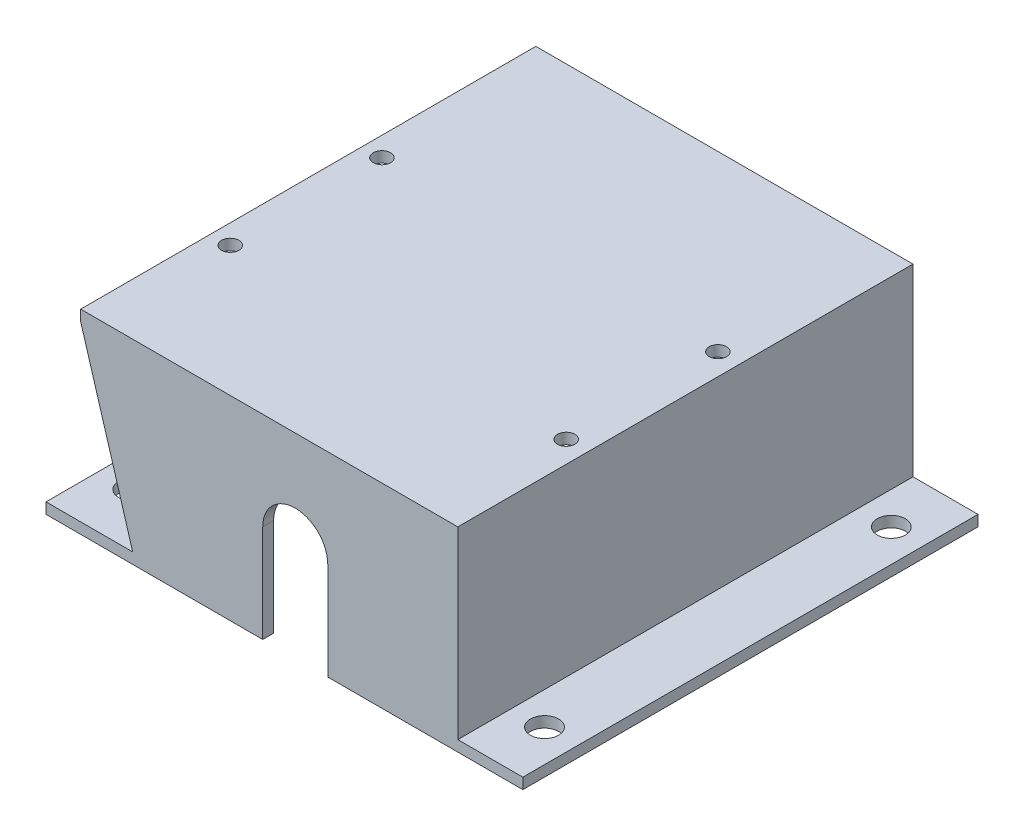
ISO-10303-21;
HEADER;
FILE_DESCRIPTION(('STEP AP214'),'2;1');
FILE_NAME('part.step','',(''),(''),'','','');
FILE_SCHEMA(('AUTOMOTIVE_DESIGN { 1 0 10303 214 1 1 1 1 }'));
ENDSEC;
DATA;
#1=APPLICATION_CONTEXT('core data for automotive mechanical design processes');
#2=APPLICATION_PROTOCOL_DEFINITION('international standard','automotive_design',2000,#1);
#3=PRODUCT_CONTEXT('',#1,'mechanical');
#4=PRODUCT('Part','Part','',(#3));
#5=PRODUCT_RELATED_PRODUCT_CATEGORY('part','',(#4));
#6=PRODUCT_DEFINITION_FORMATION('','',#4);
#7=PRODUCT_DEFINITION_CONTEXT('part definition',#1,'design');
#8=PRODUCT_DEFINITION('design','',#6,#7);
#9=PRODUCT_DEFINITION_SHAPE('','',#8);
#10=(LENGTH_UNIT() NAMED_UNIT(*) SI_UNIT(.MILLI.,.METRE.));
#11=(NAMED_UNIT(*) PLANE_ANGLE_UNIT() SI_UNIT($,.RADIAN.));
#12=(NAMED_UNIT(*) SI_UNIT($,.STERADIAN.) SOLID_ANGLE_UNIT());
#13=UNCERTAINTY_MEASURE_WITH_UNIT(LENGTH_MEASURE(1.E-05),#10,'distance_accuracy_value','');
#14=(GEOMETRIC_REPRESENTATION_CONTEXT(3) GLOBAL_UNCERTAINTY_ASSIGNED_CONTEXT((#13)) GLOBAL_UNIT_ASSIGNED_CONTEXT((#10,
#11,#12)) REPRESENTATION_CONTEXT('',''));
#15=CARTESIAN_POINT('',(0.,0.,0.));
#16=DIRECTION('',(0.,0.,1.));
#17=DIRECTION('',(1.,0.,0.));
#18=AXIS2_PLACEMENT_3D('',#15,#16,#17);
#19=CARTESIAN_POINT('',(45.,80.,210.));
#20=DIRECTION('',(-1.,0.,0.));
#21=DIRECTION('',(0.,0.,1.));
#22=AXIS2_PLACEMENT_3D('',#19,#20,#21);
#23=PLANE('',#22);
#24=DIRECTION('',(0.,-1.,0.));
#25=VECTOR('',#24,1.);
#26=CARTESIAN_POINT('',(45.,80.,5.));
#27=LINE('',#26,#25);
#28=CARTESIAN_POINT('',(45.,80.,5.));
#29=VERTEX_POINT('',#28);
#30=CARTESIAN_POINT('',(45.,-5.00000000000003,5.));
#31=VERTEX_POINT('',#30);
#32=EDGE_CURVE('E49',#29,#31,#27,.T.);
#33=ORIENTED_EDGE('',*,*,#32,.F.);
#34=DIRECTION('',(0.,0.,-1.));
#35=VECTOR('',#34,1.);
#36=CARTESIAN_POINT('',(45.,80.,210.));
#37=LINE('',#36,#35);
#38=CARTESIAN_POINT('',(45.,80.,205.));
#39=VERTEX_POINT('',#38);
#40=EDGE_CURVE('E314',#39,#29,#37,.T.);
#41=ORIENTED_EDGE('',*,*,#40,.F.);
#42=DIRECTION('',(0.,-1.,0.));
#43=VECTOR('',#42,1.);
#44=CARTESIAN_POINT('',(45.,80.,205.));
#45=LINE('',#44,#43);
#46=CARTESIAN_POINT('',(45.,-5.00000000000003,205.));
#47=VERTEX_POINT('',#46);
#48=EDGE_CURVE('E243',#39,#47,#45,.T.);
#49=ORIENTED_EDGE('',*,*,#48,.T.);
#50=DIRECTION('',(0.,0.,-1.));
#51=VECTOR('',#50,1.);
#52=CARTESIAN_POINT('',(45.,-5.00000000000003,210.));
#53=LINE('',#52,#51);
#54=EDGE_CURVE('E33',#47,#31,#53,.T.);
#55=ORIENTED_EDGE('',*,*,#54,.T.);
#56=EDGE_LOOP('',(#33,#41,#49,#55));
#57=FACE_BOUND('',#56,.T.);
#58=ADVANCED_FACE('F24',(#57),#23,.F.);
#59=CARTESIAN_POINT('',(45.,80.,210.));
#60=DIRECTION('',(0.,1.,0.));
#61=DIRECTION('',(0.,0.,1.));
#62=AXIS2_PLACEMENT_3D('',#59,#60,#61);
#63=PLANE('',#62);
#64=CARTESIAN_POINT('',(180.,80.,80.));
#65=DIRECTION('',(0.,1.,0.));
#66=DIRECTION('',(0.,0.,1.));
#67=AXIS2_PLACEMENT_3D('',#64,#65,#66);
#68=CIRCLE('',#67,3.99999999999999);
#69=CARTESIAN_POINT('',(180.,80.,84.));
#70=VERTEX_POINT('',#69);
#71=EDGE_CURVE('E665',#70,#70,#68,.T.);
#72=ORIENTED_EDGE('',*,*,#71,.T.);
#73=EDGE_LOOP('',(#72));
#74=FACE_BOUND('',#73,.T.);
#75=CARTESIAN_POINT('',(180.,80.,150.));
#76=DIRECTION('',(0.,1.,0.));
#77=DIRECTION('',(0.,0.,1.));
#78=AXIS2_PLACEMENT_3D('',#75,#76,#77);
#79=CIRCLE('',#78,4.);
#80=CARTESIAN_POINT('',(180.,80.,154.));
#81=VERTEX_POINT('',#80);
#82=EDGE_CURVE('E669',#81,#81,#79,.T.);
#83=ORIENTED_EDGE('',*,*,#82,.T.);
#84=EDGE_LOOP('',(#83));
#85=FACE_BOUND('',#84,.T.);
#86=DIRECTION('',(1.,0.,0.));
#87=VECTOR('',#86,1.);
#88=CARTESIAN_POINT('',(185.,80.,5.));
#89=LINE('',#88,#87);
#90=CARTESIAN_POINT('',(185.,80.,5.));
#91=VERTEX_POINT('',#90);
#92=EDGE_CURVE('E203',#29,#91,#89,.T.);
#93=ORIENTED_EDGE('',*,*,#92,.T.);
#94=DIRECTION('',(0.,0.,-1.));
#95=VECTOR('',#94,1.);
#96=CARTESIAN_POINT('',(185.,80.,210.));
#97=LINE('',#96,#95);
#98=CARTESIAN_POINT('',(185.,80.,205.));
#99=VERTEX_POINT('',#98);
#100=EDGE_CURVE('E311',#99,#91,#97,.T.);
#101=ORIENTED_EDGE('',*,*,#100,.F.);
#102=DIRECTION('',(-1.,0.,0.));
#103=VECTOR('',#102,1.);
#104=CARTESIAN_POINT('',(185.,80.,205.));
#105=LINE('',#104,#103);
#106=EDGE_CURVE('E227',#99,#39,#105,.T.);
#107=ORIENTED_EDGE('',*,*,#106,.T.);
#108=ORIENTED_EDGE('',*,*,#40,.T.);
#109=EDGE_LOOP('',(#93,#101,#107,#108));
#110=FACE_BOUND('',#109,.T.);
#111=ADVANCED_FACE('F394',(#74,#85,#110),#63,.F.);
#112=CARTESIAN_POINT('',(185.,80.,210.));
#113=DIRECTION('',(1.,0.,0.));
#114=DIRECTION('',(0.,1.,0.));
#115=AXIS2_PLACEMENT_3D('',#112,#113,#114);
#116=PLANE('',#115);
#117=DIRECTION('',(0.,-1.,0.));
#118=VECTOR('',#117,1.);
#119=CARTESIAN_POINT('',(185.,-5.,5.));
#120=LINE('',#119,#118);
#121=CARTESIAN_POINT('',(185.,-5.,5.));
#122=VERTEX_POINT('',#121);
#123=EDGE_CURVE('E206',#91,#122,#120,.T.);
#124=ORIENTED_EDGE('',*,*,#123,.T.);
#125=DIRECTION('',(0.,0.,-1.));
#126=VECTOR('',#125,1.);
#127=CARTESIAN_POINT('',(185.,-5.,210.));
#128=LINE('',#127,#126);
#129=CARTESIAN_POINT('',(185.,-5.,205.));
#130=VERTEX_POINT('',#129);
#131=EDGE_CURVE('E308',#130,#122,#128,.T.);
#132=ORIENTED_EDGE('',*,*,#131,.F.);
#133=DIRECTION('',(0.,1.,0.));
#134=VECTOR('',#133,1.);
#135=CARTESIAN_POINT('',(185.,-5.,205.));
#136=LINE('',#135,#134);
#137=EDGE_CURVE('E237',#130,#99,#136,.T.);
#138=ORIENTED_EDGE('',*,*,#137,.T.);
#139=ORIENTED_EDGE('',*,*,#100,.T.);
#140=EDGE_LOOP('',(#124,#132,#138,#139));
#141=FACE_BOUND('',#140,.T.);
#142=ADVANCED_FACE('F395',(#141),#116,.F.);
#143=CARTESIAN_POINT('',(40.,80.,210.));
#144=DIRECTION('',(0.,1.,0.));
#145=DIRECTION('',(0.,0.,1.));
#146=AXIS2_PLACEMENT_3D('',#143,#144,#145);
#147=PLANE('',#146);
#148=CARTESIAN_POINT('',(25.,80.,150.));
#149=DIRECTION('',(0.,1.,0.));
#150=DIRECTION('',(0.,0.,1.));
#151=AXIS2_PLACEMENT_3D('',#148,#149,#150);
#152=CIRCLE('',#151,3.99999999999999);
#153=CARTESIAN_POINT('',(25.,80.,154.));
#154=VERTEX_POINT('',#153);
#155=EDGE_CURVE('E331',#154,#154,#152,.T.);
#156=ORIENTED_EDGE('',*,*,#155,.T.);
#157=EDGE_LOOP('',(#156));
#158=FACE_BOUND('',#157,.T.);
#159=CARTESIAN_POINT('',(25.0000000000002,80.,80.));
#160=DIRECTION('',(0.,1.,0.));
#161=DIRECTION('',(0.,0.,1.));
#162=AXIS2_PLACEMENT_3D('',#159,#160,#161);
#163=CIRCLE('',#162,3.99999999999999);
#164=CARTESIAN_POINT('',(25.0000000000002,80.,84.));
#165=VERTEX_POINT('',#164);
#166=EDGE_CURVE('E318',#165,#165,#163,.T.);
#167=ORIENTED_EDGE('',*,*,#166,.T.);
#168=EDGE_LOOP('',(#167));
#169=FACE_BOUND('',#168,.T.);
#170=CARTESIAN_POINT('',(16.,80.,5.));
#171=VERTEX_POINT('',#170);
#172=CARTESIAN_POINT('',(40.,80.,5.));
#173=VERTEX_POINT('',#172);
#174=EDGE_CURVE('E204',#171,#173,#89,.T.);
#175=ORIENTED_EDGE('',*,*,#174,.T.);
#176=DIRECTION('',(0.,0.,-1.));
#177=VECTOR('',#176,1.);
#178=CARTESIAN_POINT('',(40.,80.,210.));
#179=LINE('',#178,#177);
#180=CARTESIAN_POINT('',(40.,80.,205.));
#181=VERTEX_POINT('',#180);
#182=EDGE_CURVE('E287',#181,#173,#179,.T.);
#183=ORIENTED_EDGE('',*,*,#182,.F.);
#184=CARTESIAN_POINT('',(16.,80.,205.));
#185=VERTEX_POINT('',#184);
#186=EDGE_CURVE('E226',#181,#185,#105,.T.);
#187=ORIENTED_EDGE('',*,*,#186,.T.);
#188=DIRECTION('',(0.,0.,-1.));
#189=VECTOR('',#188,1.);
#190=CARTESIAN_POINT('',(16.,80.,210.));
#191=LINE('',#190,#189);
#192=EDGE_CURVE('E290',#185,#171,#191,.T.);
#193=ORIENTED_EDGE('',*,*,#192,.T.);
#194=EDGE_LOOP('',(#175,#183,#187,#193));
#195=FACE_BOUND('',#194,.T.);
#196=ADVANCED_FACE('F397',(#158,#169,#195),#147,.F.);
#197=CARTESIAN_POINT('',(40.,0.,210.));
#198=DIRECTION('',(1.,0.,0.));
#199=DIRECTION('',(0.,0.,-1.));
#200=AXIS2_PLACEMENT_3D('',#197,#198,#199);
#201=PLANE('',#200);
#202=DIRECTION('',(0.,1.,0.));
#203=VECTOR('',#202,1.);
#204=CARTESIAN_POINT('',(40.,0.,5.));
#205=LINE('',#204,#203);
#206=CARTESIAN_POINT('',(40.,0.,5.));
#207=VERTEX_POINT('',#206);
#208=EDGE_CURVE('E218',#207,#173,#205,.T.);
#209=ORIENTED_EDGE('',*,*,#208,.F.);
#210=DIRECTION('',(0.,0.,-1.));
#211=VECTOR('',#210,1.);
#212=CARTESIAN_POINT('',(40.,0.,210.));
#213=LINE('',#212,#211);
#214=CARTESIAN_POINT('',(40.,0.,205.));
#215=VERTEX_POINT('',#214);
#216=EDGE_CURVE('E283',#215,#207,#213,.T.);
#217=ORIENTED_EDGE('',*,*,#216,.F.);
#218=DIRECTION('',(0.,1.,0.));
#219=VECTOR('',#218,1.);
#220=CARTESIAN_POINT('',(40.,0.,205.));
#221=LINE('',#220,#219);
#222=EDGE_CURVE('E240',#215,#181,#221,.T.);
#223=ORIENTED_EDGE('',*,*,#222,.T.);
#224=ORIENTED_EDGE('',*,*,#182,.T.);
#225=EDGE_LOOP('',(#209,#217,#223,#224));
#226=FACE_BOUND('',#225,.T.);
#227=ADVANCED_FACE('F404',(#226),#201,.F.);
#228=CARTESIAN_POINT('',(0.,-5.00000000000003,210.));
#229=DIRECTION('',(1.,0.,0.));
#230=DIRECTION('',(0.,0.,-1.));
#231=AXIS2_PLACEMENT_3D('',#228,#229,#230);
#232=PLANE('',#231);
#233=DIRECTION('',(0.,-1.,0.));
#234=VECTOR('',#233,1.);
#235=CARTESIAN_POINT('',(0.,-5.00000000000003,0.));
#236=LINE('',#235,#234);
#237=CARTESIAN_POINT('',(0.,0.,0.));
#238=VERTEX_POINT('',#237);
#239=CARTESIAN_POINT('',(0.,-5.00000000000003,0.));
#240=VERTEX_POINT('',#239);
#241=EDGE_CURVE('E246',#238,#240,#236,.T.);
#242=ORIENTED_EDGE('',*,*,#241,.T.);
#243=DIRECTION('',(0.,0.,-1.));
#244=VECTOR('',#243,1.);
#245=CARTESIAN_POINT('',(0.,-5.00000000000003,210.));
#246=LINE('',#245,#244);
#247=CARTESIAN_POINT('',(0.,-5.00000000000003,210.));
#248=VERTEX_POINT('',#247);
#249=EDGE_CURVE('E11',#248,#240,#246,.T.);
#250=ORIENTED_EDGE('',*,*,#249,.F.);
#251=DIRECTION('',(0.,-1.,0.));
#252=VECTOR('',#251,1.);
#253=CARTESIAN_POINT('',(0.,-5.00000000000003,210.));
#254=LINE('',#253,#252);
#255=CARTESIAN_POINT('',(0.,0.,210.));
#256=VERTEX_POINT('',#255);
#257=EDGE_CURVE('E263',#256,#248,#254,.T.);
#258=ORIENTED_EDGE('',*,*,#257,.F.);
#259=DIRECTION('',(0.,0.,-1.));
#260=VECTOR('',#259,1.);
#261=CARTESIAN_POINT('',(0.,0.,210.));
#262=LINE('',#261,#260);
#263=EDGE_CURVE('E280',#256,#238,#262,.T.);
#264=ORIENTED_EDGE('',*,*,#263,.T.);
#265=EDGE_LOOP('',(#242,#250,#258,#264));
#266=FACE_BOUND('',#265,.T.);
#267=ADVANCED_FACE('F26',(#266),#232,.F.);
#268=CARTESIAN_POINT('',(220.,-5.,210.));
#269=DIRECTION('',(0.,1.,0.));
#270=DIRECTION('',(-1.,0.,0.));
#271=AXIS2_PLACEMENT_3D('',#268,#269,#270);
#272=PLANE('',#271);
#273=CARTESIAN_POINT('',(25.,-5.00000000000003,150.));
#274=DIRECTION('',(0.,1.,0.));
#275=DIRECTION('',(0.,0.,1.));
#276=AXIS2_PLACEMENT_3D('',#273,#274,#275);
#277=CIRCLE('',#276,3.39999999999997);
#278=CARTESIAN_POINT('',(25.,-5.00000000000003,153.4));
#279=VERTEX_POINT('',#278);
#280=EDGE_CURVE('E675',#279,#279,#277,.T.);
#281=ORIENTED_EDGE('',*,*,#280,.T.);
#282=EDGE_LOOP('',(#281));
#283=FACE_BOUND('',#282,.T.);
#284=CARTESIAN_POINT('',(25.0000000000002,-5.00000000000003,80.));
#285=DIRECTION('',(0.,1.,0.));
#286=DIRECTION('',(0.,0.,1.));
#287=AXIS2_PLACEMENT_3D('',#284,#285,#286);
#288=CIRCLE('',#287,3.39999999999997);
#289=CARTESIAN_POINT('',(25.0000000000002,-5.00000000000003,83.4));
#290=VERTEX_POINT('',#289);
#291=EDGE_CURVE('E326',#290,#290,#288,.T.);
#292=ORIENTED_EDGE('',*,*,#291,.T.);
#293=EDGE_LOOP('',(#292));
#294=FACE_BOUND('',#293,.T.);
#295=CARTESIAN_POINT('',(15.,-5.00000000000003,25.));
#296=DIRECTION('',(0.,-1.,0.));
#297=DIRECTION('',(1.,0.,0.));
#298=AXIS2_PLACEMENT_3D('',#295,#296,#297);
#299=CIRCLE('',#298,6.50000000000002);
#300=CARTESIAN_POINT('',(21.5,-5.00000000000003,25.));
#301=VERTEX_POINT('',#300);
#302=EDGE_CURVE('E323',#301,#301,#299,.T.);
#303=ORIENTED_EDGE('',*,*,#302,.F.);
#304=EDGE_LOOP('',(#303));
#305=FACE_BOUND('',#304,.T.);
#306=CARTESIAN_POINT('',(205.,-5.,25.));
#307=DIRECTION('',(0.,-1.,0.));
#308=DIRECTION('',(1.,0.,0.));
#309=AXIS2_PLACEMENT_3D('',#306,#307,#308);
#310=CIRCLE('',#309,6.50000000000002);
#311=CARTESIAN_POINT('',(211.5,-5.,25.));
#312=VERTEX_POINT('',#311);
#313=EDGE_CURVE('E340',#312,#312,#310,.T.);
#314=ORIENTED_EDGE('',*,*,#313,.F.);
#315=EDGE_LOOP('',(#314));
#316=FACE_BOUND('',#315,.T.);
#317=CARTESIAN_POINT('',(15.,-5.00000000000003,185.));
#318=DIRECTION('',(0.,-1.,0.));
#319=DIRECTION('',(1.,0.,0.));
#320=AXIS2_PLACEMENT_3D('',#317,#318,#319);
#321=CIRCLE('',#320,6.50000000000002);
#322=CARTESIAN_POINT('',(21.5,-5.00000000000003,185.));
#323=VERTEX_POINT('',#322);
#324=EDGE_CURVE('E346',#323,#323,#321,.T.);
#325=ORIENTED_EDGE('',*,*,#324,.F.);
#326=EDGE_LOOP('',(#325));
#327=FACE_BOUND('',#326,.T.);
#328=CARTESIAN_POINT('',(205.,-5.,185.));
#329=DIRECTION('',(0.,-1.,0.));
#330=DIRECTION('',(1.,0.,0.));
#331=AXIS2_PLACEMENT_3D('',#328,#329,#330);
#332=CIRCLE('',#331,6.50000000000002);
#333=CARTESIAN_POINT('',(211.5,-5.,185.));
#334=VERTEX_POINT('',#333);
#335=EDGE_CURVE('E352',#334,#334,#332,.T.);
#336=ORIENTED_EDGE('',*,*,#335,.F.);
#337=EDGE_LOOP('',(#336));
#338=FACE_BOUND('',#337,.T.);
#339=DIRECTION('',(1.,0.,0.));
#340=VECTOR('',#339,1.);
#341=CARTESIAN_POINT('',(45.,-5.00000000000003,210.));
#342=LINE('',#341,#340);
#343=CARTESIAN_POINT('',(130.,-5.00000000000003,210.));
#344=VERTEX_POINT('',#343);
#345=CARTESIAN_POINT('',(220.,-5.,210.));
#346=VERTEX_POINT('',#345);
#347=EDGE_CURVE('E265',#344,#346,#342,.T.);
#348=ORIENTED_EDGE('',*,*,#347,.F.);
#349=DIRECTION('',(0.,0.,1.));
#350=VECTOR('',#349,1.);
#351=CARTESIAN_POINT('',(130.,-5.00000000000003,205.));
#352=LINE('',#351,#350);
#353=CARTESIAN_POINT('',(130.,-5.00000000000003,205.));
#354=VERTEX_POINT('',#353);
#355=EDGE_CURVE('E198',#354,#344,#352,.T.);
#356=ORIENTED_EDGE('',*,*,#355,.F.);
#357=DIRECTION('',(1.,0.,0.));
#358=VECTOR('',#357,1.);
#359=CARTESIAN_POINT('',(45.,-5.00000000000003,205.));
#360=LINE('',#359,#358);
#361=EDGE_CURVE('E233',#354,#130,#360,.T.);
#362=ORIENTED_EDGE('',*,*,#361,.T.);
#363=ORIENTED_EDGE('',*,*,#131,.T.);
#364=DIRECTION('',(-1.,0.,0.));
#365=VECTOR('',#364,1.);
#366=CARTESIAN_POINT('',(45.,-5.00000000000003,5.));
#367=LINE('',#366,#365);
#368=EDGE_CURVE('E208',#122,#31,#367,.T.);
#369=ORIENTED_EDGE('',*,*,#368,.T.);
#370=ORIENTED_EDGE('',*,*,#54,.F.);
#371=CARTESIAN_POINT('',(100.,-5.00000000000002,205.));
#372=VERTEX_POINT('',#371);
#373=EDGE_CURVE('E234',#47,#372,#360,.T.);
#374=ORIENTED_EDGE('',*,*,#373,.T.);
#375=DIRECTION('',(0.,0.,1.));
#376=VECTOR('',#375,1.);
#377=CARTESIAN_POINT('',(100.,-5.00000000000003,205.));
#378=LINE('',#377,#376);
#379=CARTESIAN_POINT('',(100.,-5.00000000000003,210.));
#380=VERTEX_POINT('',#379);
#381=EDGE_CURVE('E41',#372,#380,#378,.T.);
#382=ORIENTED_EDGE('',*,*,#381,.T.);
#383=EDGE_CURVE('E185',#248,#380,#342,.T.);
#384=ORIENTED_EDGE('',*,*,#383,.F.);
#385=ORIENTED_EDGE('',*,*,#249,.T.);
#386=DIRECTION('',(1.,0.,0.));
#387=VECTOR('',#386,1.);
#388=CARTESIAN_POINT('',(220.,-5.,0.));
#389=LINE('',#388,#387);
#390=CARTESIAN_POINT('',(220.,-5.,0.));
#391=VERTEX_POINT('',#390);
#392=EDGE_CURVE('E249',#240,#391,#389,.T.);
#393=ORIENTED_EDGE('',*,*,#392,.T.);
#394=DIRECTION('',(0.,0.,-1.));
#395=VECTOR('',#394,1.);
#396=CARTESIAN_POINT('',(220.,-5.,210.));
#397=LINE('',#396,#395);
#398=EDGE_CURVE('E305',#346,#391,#397,.T.);
#399=ORIENTED_EDGE('',*,*,#398,.F.);
#400=EDGE_LOOP('',(#348,#356,#362,#363,#369,#370,#374,#382,#384,#385,#393,#399));
#401=FACE_BOUND('',#400,.T.);
#402=ADVANCED_FACE('F367',(#283,#294,#305,#316,#327,#338,#401),#272,.F.);
#403=CARTESIAN_POINT('',(220.,0.,210.));
#404=DIRECTION('',(-1.,0.,0.));
#405=DIRECTION('',(0.,0.,1.));
#406=AXIS2_PLACEMENT_3D('',#403,#404,#405);
#407=PLANE('',#406);
#408=DIRECTION('',(0.,1.,0.));
#409=VECTOR('',#408,1.);
#410=CARTESIAN_POINT('',(220.,0.,0.));
#411=LINE('',#410,#409);
#412=CARTESIAN_POINT('',(220.,0.,0.));
#413=VERTEX_POINT('',#412);
#414=EDGE_CURVE('E251',#391,#413,#411,.T.);
#415=ORIENTED_EDGE('',*,*,#414,.T.);
#416=DIRECTION('',(0.,0.,-1.));
#417=VECTOR('',#416,1.);
#418=CARTESIAN_POINT('',(220.,0.,210.));
#419=LINE('',#418,#417);
#420=CARTESIAN_POINT('',(220.,0.,210.));
#421=VERTEX_POINT('',#420);
#422=EDGE_CURVE('E302',#421,#413,#419,.T.);
#423=ORIENTED_EDGE('',*,*,#422,.F.);
#424=DIRECTION('',(0.,1.,0.));
#425=VECTOR('',#424,1.);
#426=CARTESIAN_POINT('',(220.,0.,210.));
#427=LINE('',#426,#425);
#428=EDGE_CURVE('E267',#346,#421,#427,.T.);
#429=ORIENTED_EDGE('',*,*,#428,.F.);
#430=ORIENTED_EDGE('',*,*,#398,.T.);
#431=EDGE_LOOP('',(#415,#423,#429,#430));
#432=FACE_BOUND('',#431,.T.);
#433=ADVANCED_FACE('F370',(#432),#407,.F.);
#434=CARTESIAN_POINT('',(190.,0.,210.));
#435=DIRECTION('',(0.,-1.,0.));
#436=DIRECTION('',(0.,0.,-1.));
#437=AXIS2_PLACEMENT_3D('',#434,#435,#436);
#438=PLANE('',#437);
#439=CARTESIAN_POINT('',(205.,0.,25.));
#440=DIRECTION('',(0.,-1.,0.));
#441=DIRECTION('',(1.,0.,0.));
#442=AXIS2_PLACEMENT_3D('',#439,#440,#441);
#443=CIRCLE('',#442,6.50000000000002);
#444=CARTESIAN_POINT('',(211.5,0.,25.));
#445=VERTEX_POINT('',#444);
#446=EDGE_CURVE('E343',#445,#445,#443,.T.);
#447=ORIENTED_EDGE('',*,*,#446,.T.);
#448=EDGE_LOOP('',(#447));
#449=FACE_BOUND('',#448,.T.);
#450=CARTESIAN_POINT('',(205.,0.,185.));
#451=DIRECTION('',(0.,-1.,0.));
#452=DIRECTION('',(1.,0.,0.));
#453=AXIS2_PLACEMENT_3D('',#450,#451,#452);
#454=CIRCLE('',#453,6.50000000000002);
#455=CARTESIAN_POINT('',(211.5,0.,185.));
#456=VERTEX_POINT('',#455);
#457=EDGE_CURVE('E180',#456,#456,#454,.T.);
#458=ORIENTED_EDGE('',*,*,#457,.T.);
#459=EDGE_LOOP('',(#458));
#460=FACE_BOUND('',#459,.T.);
#461=DIRECTION('',(-1.,0.,0.));
#462=VECTOR('',#461,1.);
#463=CARTESIAN_POINT('',(190.,0.,0.));
#464=LINE('',#463,#462);
#465=CARTESIAN_POINT('',(190.,0.,0.));
#466=VERTEX_POINT('',#465);
#467=EDGE_CURVE('E253',#413,#466,#464,.T.);
#468=ORIENTED_EDGE('',*,*,#467,.T.);
#469=DIRECTION('',(0.,0.,-1.));
#470=VECTOR('',#469,1.);
#471=CARTESIAN_POINT('',(190.,0.,210.));
#472=LINE('',#471,#470);
#473=CARTESIAN_POINT('',(190.,0.,210.));
#474=VERTEX_POINT('',#473);
#475=EDGE_CURVE('E299',#474,#466,#472,.T.);
#476=ORIENTED_EDGE('',*,*,#475,.F.);
#477=DIRECTION('',(-1.,0.,0.));
#478=VECTOR('',#477,1.);
#479=CARTESIAN_POINT('',(190.,0.,210.));
#480=LINE('',#479,#478);
#481=EDGE_CURVE('E269',#421,#474,#480,.T.);
#482=ORIENTED_EDGE('',*,*,#481,.F.);
#483=ORIENTED_EDGE('',*,*,#422,.T.);
#484=EDGE_LOOP('',(#468,#476,#482,#483));
#485=FACE_BOUND('',#484,.T.);
#486=ADVANCED_FACE('F357',(#449,#460,#485),#438,.F.);
#487=CARTESIAN_POINT('',(190.,85.,210.));
#488=DIRECTION('',(-1.,0.,0.));
#489=DIRECTION('',(0.,-1.,0.));
#490=AXIS2_PLACEMENT_3D('',#487,#488,#489);
#491=PLANE('',#490);
#492=DIRECTION('',(0.,1.,0.));
#493=VECTOR('',#492,1.);
#494=CARTESIAN_POINT('',(190.,85.,0.));
#495=LINE('',#494,#493);
#496=CARTESIAN_POINT('',(190.,85.,0.));
#497=VERTEX_POINT('',#496);
#498=EDGE_CURVE('E255',#466,#497,#495,.T.);
#499=ORIENTED_EDGE('',*,*,#498,.T.);
#500=DIRECTION('',(0.,0.,-1.));
#501=VECTOR('',#500,1.);
#502=CARTESIAN_POINT('',(190.,85.,210.));
#503=LINE('',#502,#501);
#504=CARTESIAN_POINT('',(190.,85.,210.));
#505=VERTEX_POINT('',#504);
#506=EDGE_CURVE('E296',#505,#497,#503,.T.);
#507=ORIENTED_EDGE('',*,*,#506,.F.);
#508=DIRECTION('',(0.,1.,0.));
#509=VECTOR('',#508,1.);
#510=CARTESIAN_POINT('',(190.,85.,210.));
#511=LINE('',#510,#509);
#512=EDGE_CURVE('E271',#474,#505,#511,.T.);
#513=ORIENTED_EDGE('',*,*,#512,.F.);
#514=ORIENTED_EDGE('',*,*,#475,.T.);
#515=EDGE_LOOP('',(#499,#507,#513,#514));
#516=FACE_BOUND('',#515,.T.);
#517=ADVANCED_FACE('F435',(#516),#491,.F.);
#518=CARTESIAN_POINT('',(16.,85.,210.));
#519=DIRECTION('',(0.,-1.,0.));
#520=DIRECTION('',(0.,0.,-1.));
#521=AXIS2_PLACEMENT_3D('',#518,#519,#520);
#522=PLANE('',#521);
#523=CARTESIAN_POINT('',(180.,85.,80.));
#524=DIRECTION('',(0.,1.,0.));
#525=DIRECTION('',(0.,0.,1.));
#526=AXIS2_PLACEMENT_3D('',#523,#524,#525);
#527=CIRCLE('',#526,4.);
#528=CARTESIAN_POINT('',(180.,85.,84.));
#529=VERTEX_POINT('',#528);
#530=EDGE_CURVE('E662',#529,#529,#527,.T.);
#531=ORIENTED_EDGE('',*,*,#530,.F.);
#532=EDGE_LOOP('',(#531));
#533=FACE_BOUND('',#532,.T.);
#534=CARTESIAN_POINT('',(180.,85.,150.));
#535=DIRECTION('',(0.,1.,0.));
#536=DIRECTION('',(0.,0.,1.));
#537=AXIS2_PLACEMENT_3D('',#534,#535,#536);
#538=CIRCLE('',#537,4.);
#539=CARTESIAN_POINT('',(180.,85.,154.));
#540=VERTEX_POINT('',#539);
#541=EDGE_CURVE('E666',#540,#540,#538,.T.);
#542=ORIENTED_EDGE('',*,*,#541,.F.);
#543=EDGE_LOOP('',(#542));
#544=FACE_BOUND('',#543,.T.);
#545=CARTESIAN_POINT('',(25.,85.,150.));
#546=DIRECTION('',(0.,1.,0.));
#547=DIRECTION('',(0.,0.,1.));
#548=AXIS2_PLACEMENT_3D('',#545,#546,#547);
#549=CIRCLE('',#548,3.99999999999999);
#550=CARTESIAN_POINT('',(25.,85.,154.));
#551=VERTEX_POINT('',#550);
#552=EDGE_CURVE('E678',#551,#551,#549,.T.);
#553=ORIENTED_EDGE('',*,*,#552,.F.);
#554=EDGE_LOOP('',(#553));
#555=FACE_BOUND('',#554,.T.);
#556=CARTESIAN_POINT('',(25.0000000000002,85.,80.));
#557=DIRECTION('',(0.,1.,0.));
#558=DIRECTION('',(0.,0.,1.));
#559=AXIS2_PLACEMENT_3D('',#556,#557,#558);
#560=CIRCLE('',#559,3.99999999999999);
#561=CARTESIAN_POINT('',(25.0000000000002,85.,84.));
#562=VERTEX_POINT('',#561);
#563=EDGE_CURVE('E319',#562,#562,#560,.T.);
#564=ORIENTED_EDGE('',*,*,#563,.F.);
#565=EDGE_LOOP('',(#564));
#566=FACE_BOUND('',#565,.T.);
#567=DIRECTION('',(-1.,0.,0.));
#568=VECTOR('',#567,1.);
#569=CARTESIAN_POINT('',(16.,85.,0.));
#570=LINE('',#569,#568);
#571=CARTESIAN_POINT('',(16.,85.,0.));
#572=VERTEX_POINT('',#571);
#573=EDGE_CURVE('E257',#497,#572,#570,.T.);
#574=ORIENTED_EDGE('',*,*,#573,.T.);
#575=DIRECTION('',(0.,0.,-1.));
#576=VECTOR('',#575,1.);
#577=CARTESIAN_POINT('',(16.,85.,210.));
#578=LINE('',#577,#576);
#579=CARTESIAN_POINT('',(16.,85.,210.));
#580=VERTEX_POINT('',#579);
#581=EDGE_CURVE('E293',#580,#572,#578,.T.);
#582=ORIENTED_EDGE('',*,*,#581,.F.);
#583=DIRECTION('',(-1.,0.,0.));
#584=VECTOR('',#583,1.);
#585=CARTESIAN_POINT('',(16.,85.,210.));
#586=LINE('',#585,#584);
#587=EDGE_CURVE('E273',#505,#580,#586,.T.);
#588=ORIENTED_EDGE('',*,*,#587,.F.);
#589=ORIENTED_EDGE('',*,*,#506,.T.);
#590=EDGE_LOOP('',(#574,#582,#588,#589));
#591=FACE_BOUND('',#590,.T.);
#592=ADVANCED_FACE('F439',(#533,#544,#555,#566,#591),#522,.F.);
#593=CARTESIAN_POINT('',(16.,80.,210.));
#594=DIRECTION('',(1.,0.,0.));
#595=DIRECTION('',(0.,0.,-1.));
#596=AXIS2_PLACEMENT_3D('',#593,#594,#595);
#597=PLANE('',#596);
#598=DIRECTION('',(0.,-1.,0.));
#599=VECTOR('',#598,1.);
#600=CARTESIAN_POINT('',(16.,80.,0.));
#601=LINE('',#600,#599);
#602=CARTESIAN_POINT('',(16.,80.,0.));
#603=VERTEX_POINT('',#602);
#604=EDGE_CURVE('E259',#572,#603,#601,.T.);
#605=ORIENTED_EDGE('',*,*,#604,.T.);
#606=DIRECTION('',(0.,0.,-1.));
#607=VECTOR('',#606,1.);
#608=CARTESIAN_POINT('',(16.,80.,5.));
#609=LINE('',#608,#607);
#610=EDGE_CURVE('E215',#171,#603,#609,.T.);
#611=ORIENTED_EDGE('',*,*,#610,.F.);
#612=ORIENTED_EDGE('',*,*,#192,.F.);
#613=CARTESIAN_POINT('',(16.,80.,210.));
#614=VERTEX_POINT('',#613);
#615=EDGE_CURVE('E291',#614,#185,#191,.T.);
#616=ORIENTED_EDGE('',*,*,#615,.F.);
#617=DIRECTION('',(0.,-1.,0.));
#618=VECTOR('',#617,1.);
#619=CARTESIAN_POINT('',(16.,80.,210.));
#620=LINE('',#619,#618);
#621=EDGE_CURVE('E275',#580,#614,#620,.T.);
#622=ORIENTED_EDGE('',*,*,#621,.F.);
#623=ORIENTED_EDGE('',*,*,#581,.T.);
#624=EDGE_LOOP('',(#605,#611,#612,#616,#622,#623));
#625=FACE_BOUND('',#624,.T.);
#626=ADVANCED_FACE('F492',(#625),#597,.F.);
#627=CARTESIAN_POINT('',(0.,0.,210.));
#628=DIRECTION('',(0.,-1.,0.));
#629=DIRECTION('',(0.,0.,-1.));
#630=AXIS2_PLACEMENT_3D('',#627,#628,#629);
#631=PLANE('',#630);
#632=CARTESIAN_POINT('',(25.,0.,150.));
#633=DIRECTION('',(0.,-1.,0.));
#634=DIRECTION('',(0.,0.,-1.));
#635=AXIS2_PLACEMENT_3D('',#632,#633,#634);
#636=CIRCLE('',#635,3.39999999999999);
#637=CARTESIAN_POINT('',(25.,0.,146.6));
#638=VERTEX_POINT('',#637);
#639=EDGE_CURVE('E28',#638,#638,#636,.T.);
#640=ORIENTED_EDGE('',*,*,#639,.T.);
#641=EDGE_LOOP('',(#640));
#642=FACE_BOUND('',#641,.T.);
#643=CARTESIAN_POINT('',(25.0000000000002,0.,80.));
#644=DIRECTION('',(0.,-1.,0.));
#645=DIRECTION('',(0.,0.,-1.));
#646=AXIS2_PLACEMENT_3D('',#643,#644,#645);
#647=CIRCLE('',#646,3.39999999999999);
#648=CARTESIAN_POINT('',(25.0000000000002,0.,76.6));
#649=VERTEX_POINT('',#648);
#650=EDGE_CURVE('E316',#649,#649,#647,.T.);
#651=ORIENTED_EDGE('',*,*,#650,.T.);
#652=EDGE_LOOP('',(#651));
#653=FACE_BOUND('',#652,.T.);
#654=CARTESIAN_POINT('',(15.,0.,25.));
#655=DIRECTION('',(0.,-1.,0.));
#656=DIRECTION('',(1.,0.,0.));
#657=AXIS2_PLACEMENT_3D('',#654,#655,#656);
#658=CIRCLE('',#657,6.50000000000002);
#659=CARTESIAN_POINT('',(21.5,0.,25.));
#660=VERTEX_POINT('',#659);
#661=EDGE_CURVE('E337',#660,#660,#658,.T.);
#662=ORIENTED_EDGE('',*,*,#661,.T.);
#663=EDGE_LOOP('',(#662));
#664=FACE_BOUND('',#663,.T.);
#665=CARTESIAN_POINT('',(15.,0.,185.));
#666=DIRECTION('',(0.,-1.,0.));
#667=DIRECTION('',(1.,0.,0.));
#668=AXIS2_PLACEMENT_3D('',#665,#666,#667);
#669=CIRCLE('',#668,6.50000000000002);
#670=CARTESIAN_POINT('',(21.5,0.,185.));
#671=VERTEX_POINT('',#670);
#672=EDGE_CURVE('E349',#671,#671,#669,.T.);
#673=ORIENTED_EDGE('',*,*,#672,.T.);
#674=EDGE_LOOP('',(#673));
#675=FACE_BOUND('',#674,.T.);
#676=DIRECTION('',(-1.,0.,0.));
#677=VECTOR('',#676,1.);
#678=CARTESIAN_POINT('',(0.,0.,0.));
#679=LINE('',#678,#677);
#680=CARTESIAN_POINT('',(40.,0.,0.));
#681=VERTEX_POINT('',#680);
#682=EDGE_CURVE('E261',#681,#238,#679,.T.);
#683=ORIENTED_EDGE('',*,*,#682,.T.);
#684=ORIENTED_EDGE('',*,*,#263,.F.);
#685=DIRECTION('',(-1.,0.,0.));
#686=VECTOR('',#685,1.);
#687=CARTESIAN_POINT('',(0.,0.,210.));
#688=LINE('',#687,#686);
#689=CARTESIAN_POINT('',(40.,0.,210.));
#690=VERTEX_POINT('',#689);
#691=EDGE_CURVE('E278',#690,#256,#688,.T.);
#692=ORIENTED_EDGE('',*,*,#691,.F.);
#693=EDGE_CURVE('E284',#690,#215,#213,.T.);
#694=ORIENTED_EDGE('',*,*,#693,.T.);
#695=ORIENTED_EDGE('',*,*,#216,.T.);
#696=DIRECTION('',(0.,0.,-1.));
#697=VECTOR('',#696,1.);
#698=CARTESIAN_POINT('',(40.,0.,5.));
#699=LINE('',#698,#697);
#700=EDGE_CURVE('E214',#207,#681,#699,.T.);
#701=ORIENTED_EDGE('',*,*,#700,.T.);
#702=EDGE_LOOP('',(#683,#684,#692,#694,#695,#701));
#703=FACE_BOUND('',#702,.T.);
#704=ADVANCED_FACE('F484',(#642,#653,#664,#675,#703),#631,.F.);
#705=CARTESIAN_POINT('',(0.,0.,210.));
#706=DIRECTION('',(0.,0.,-1.));
#707=DIRECTION('',(-1.,0.,0.));
#708=AXIS2_PLACEMENT_3D('',#705,#706,#707);
#709=PLANE('',#708);
#710=CARTESIAN_POINT('',(115.,40.,210.));
#711=DIRECTION('',(0.,0.,1.));
#712=DIRECTION('',(1.,0.,0.));
#713=AXIS2_PLACEMENT_3D('',#710,#711,#712);
#714=CIRCLE('',#713,15.);
#715=CARTESIAN_POINT('',(130.,40.,210.));
#716=VERTEX_POINT('',#715);
#717=CARTESIAN_POINT('',(100.,40.,210.));
#718=VERTEX_POINT('',#717);
#719=EDGE_CURVE('E174',#716,#718,#714,.T.);
#720=ORIENTED_EDGE('',*,*,#719,.F.);
#721=DIRECTION('',(0.,1.,0.));
#722=VECTOR('',#721,1.);
#723=CARTESIAN_POINT('',(130.,40.,210.));
#724=LINE('',#723,#722);
#725=EDGE_CURVE('E186',#344,#716,#724,.T.);
#726=ORIENTED_EDGE('',*,*,#725,.F.);
#727=ORIENTED_EDGE('',*,*,#347,.T.);
#728=ORIENTED_EDGE('',*,*,#428,.T.);
#729=ORIENTED_EDGE('',*,*,#481,.T.);
#730=ORIENTED_EDGE('',*,*,#512,.T.);
#731=ORIENTED_EDGE('',*,*,#587,.T.);
#732=ORIENTED_EDGE('',*,*,#621,.T.);
#733=DIRECTION('',(0.287347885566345,-0.957826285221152,0.));
#734=VECTOR('',#733,1.);
#735=CARTESIAN_POINT('',(16.,80.,210.));
#736=LINE('',#735,#734);
#737=EDGE_CURVE('E223',#614,#690,#736,.T.);
#738=ORIENTED_EDGE('',*,*,#737,.T.);
#739=ORIENTED_EDGE('',*,*,#691,.T.);
#740=ORIENTED_EDGE('',*,*,#257,.T.);
#741=ORIENTED_EDGE('',*,*,#383,.T.);
#742=DIRECTION('',(0.,-1.,0.));
#743=VECTOR('',#742,1.);
#744=CARTESIAN_POINT('',(100.,40.,210.));
#745=LINE('',#744,#743);
#746=EDGE_CURVE('E166',#718,#380,#745,.T.);
#747=ORIENTED_EDGE('',*,*,#746,.F.);
#748=EDGE_LOOP('',(#720,#726,#727,#728,#729,#730,#731,#732,#738,#739,#740,#741,#747));
#749=FACE_BOUND('',#748,.T.);
#750=ADVANCED_FACE('F183',(#749),#709,.F.);
#751=CARTESIAN_POINT('',(0.,0.,0.));
#752=DIRECTION('',(0.,0.,-1.));
#753=DIRECTION('',(-1.,0.,0.));
#754=AXIS2_PLACEMENT_3D('',#751,#752,#753);
#755=PLANE('',#754);
#756=ORIENTED_EDGE('',*,*,#682,.F.);
#757=DIRECTION('',(-0.287347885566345,0.957826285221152,0.));
#758=VECTOR('',#757,1.);
#759=CARTESIAN_POINT('',(16.,80.,0.));
#760=LINE('',#759,#758);
#761=EDGE_CURVE('E197',#681,#603,#760,.T.);
#762=ORIENTED_EDGE('',*,*,#761,.T.);
#763=ORIENTED_EDGE('',*,*,#604,.F.);
#764=ORIENTED_EDGE('',*,*,#573,.F.);
#765=ORIENTED_EDGE('',*,*,#498,.F.);
#766=ORIENTED_EDGE('',*,*,#467,.F.);
#767=ORIENTED_EDGE('',*,*,#414,.F.);
#768=ORIENTED_EDGE('',*,*,#392,.F.);
#769=ORIENTED_EDGE('',*,*,#241,.F.);
#770=EDGE_LOOP('',(#756,#762,#763,#764,#765,#766,#767,#768,#769));
#771=FACE_BOUND('',#770,.T.);
#772=ADVANCED_FACE('F469',(#771),#755,.T.);
#773=CARTESIAN_POINT('',(185.,80.,205.));
#774=DIRECTION('',(0.,0.,-1.));
#775=DIRECTION('',(-1.,0.,0.));
#776=AXIS2_PLACEMENT_3D('',#773,#774,#775);
#777=PLANE('',#776);
#778=DIRECTION('',(0.,1.,0.));
#779=VECTOR('',#778,1.);
#780=CARTESIAN_POINT('',(130.,40.,205.));
#781=LINE('',#780,#779);
#782=CARTESIAN_POINT('',(130.,40.,205.));
#783=VERTEX_POINT('',#782);
#784=EDGE_CURVE('E171',#354,#783,#781,.T.);
#785=ORIENTED_EDGE('',*,*,#784,.T.);
#786=CARTESIAN_POINT('',(115.,40.,205.));
#787=DIRECTION('',(0.,0.,1.));
#788=DIRECTION('',(1.,0.,0.));
#789=AXIS2_PLACEMENT_3D('',#786,#787,#788);
#790=CIRCLE('',#789,15.);
#791=CARTESIAN_POINT('',(100.,40.,205.));
#792=VERTEX_POINT('',#791);
#793=EDGE_CURVE('E188',#783,#792,#790,.T.);
#794=ORIENTED_EDGE('',*,*,#793,.T.);
#795=DIRECTION('',(0.,-1.,0.));
#796=VECTOR('',#795,1.);
#797=CARTESIAN_POINT('',(100.,40.,205.));
#798=LINE('',#797,#796);
#799=EDGE_CURVE('E167',#792,#372,#798,.T.);
#800=ORIENTED_EDGE('',*,*,#799,.T.);
#801=ORIENTED_EDGE('',*,*,#373,.F.);
#802=ORIENTED_EDGE('',*,*,#48,.F.);
#803=ORIENTED_EDGE('',*,*,#106,.F.);
#804=ORIENTED_EDGE('',*,*,#137,.F.);
#805=ORIENTED_EDGE('',*,*,#361,.F.);
#806=EDGE_LOOP('',(#785,#794,#800,#801,#802,#803,#804,#805));
#807=FACE_BOUND('',#806,.T.);
#808=ADVANCED_FACE('F382',(#807),#777,.T.);
#809=ORIENTED_EDGE('',*,*,#222,.F.);
#810=DIRECTION('',(0.287347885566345,-0.957826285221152,0.));
#811=VECTOR('',#810,1.);
#812=CARTESIAN_POINT('',(16.,80.,205.));
#813=LINE('',#812,#811);
#814=EDGE_CURVE('E230',#185,#215,#813,.T.);
#815=ORIENTED_EDGE('',*,*,#814,.F.);
#816=ORIENTED_EDGE('',*,*,#186,.F.);
#817=EDGE_LOOP('',(#809,#815,#816));
#818=FACE_BOUND('',#817,.T.);
#819=ADVANCED_FACE('F421',(#818),#777,.T.);
#820=CARTESIAN_POINT('',(16.,80.,205.));
#821=DIRECTION('',(-0.957826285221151,-0.287347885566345,0.));
#822=DIRECTION('',(0.287347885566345,-0.957826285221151,0.));
#823=AXIS2_PLACEMENT_3D('',#820,#821,#822);
#824=PLANE('',#823);
#825=ORIENTED_EDGE('',*,*,#737,.F.);
#826=ORIENTED_EDGE('',*,*,#615,.T.);
#827=ORIENTED_EDGE('',*,*,#814,.T.);
#828=ORIENTED_EDGE('',*,*,#693,.F.);
#829=EDGE_LOOP('',(#825,#826,#827,#828));
#830=FACE_BOUND('',#829,.T.);
#831=ADVANCED_FACE('F417',(#830),#824,.T.);
#832=CARTESIAN_POINT('',(185.,80.,5.));
#833=DIRECTION('',(0.,0.,-1.));
#834=DIRECTION('',(-1.,0.,0.));
#835=AXIS2_PLACEMENT_3D('',#832,#833,#834);
#836=PLANE('',#835);
#837=ORIENTED_EDGE('',*,*,#92,.F.);
#838=ORIENTED_EDGE('',*,*,#32,.T.);
#839=ORIENTED_EDGE('',*,*,#368,.F.);
#840=ORIENTED_EDGE('',*,*,#123,.F.);
#841=EDGE_LOOP('',(#837,#838,#839,#840));
#842=FACE_BOUND('',#841,.T.);
#843=ADVANCED_FACE('F391',(#842),#836,.F.);
#844=DIRECTION('',(-0.287347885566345,0.957826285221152,0.));
#845=VECTOR('',#844,1.);
#846=CARTESIAN_POINT('',(16.,80.,5.));
#847=LINE('',#846,#845);
#848=EDGE_CURVE('E211',#207,#171,#847,.T.);
#849=ORIENTED_EDGE('',*,*,#848,.F.);
#850=ORIENTED_EDGE('',*,*,#208,.T.);
#851=ORIENTED_EDGE('',*,*,#174,.F.);
#852=EDGE_LOOP('',(#849,#850,#851));
#853=FACE_BOUND('',#852,.T.);
#854=ADVANCED_FACE('F582',(#853),#836,.F.);
#855=CARTESIAN_POINT('',(16.,80.,5.));
#856=DIRECTION('',(-0.957826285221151,-0.287347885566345,0.));
#857=DIRECTION('',(0.287347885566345,-0.957826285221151,0.));
#858=AXIS2_PLACEMENT_3D('',#855,#856,#857);
#859=PLANE('',#858);
#860=ORIENTED_EDGE('',*,*,#761,.F.);
#861=ORIENTED_EDGE('',*,*,#700,.F.);
#862=ORIENTED_EDGE('',*,*,#848,.T.);
#863=ORIENTED_EDGE('',*,*,#610,.T.);
#864=EDGE_LOOP('',(#860,#861,#862,#863));
#865=FACE_BOUND('',#864,.T.);
#866=ADVANCED_FACE('F570',(#865),#859,.T.);
#867=CARTESIAN_POINT('',(115.,40.,205.));
#868=DIRECTION('',(0.,0.,1.));
#869=DIRECTION('',(1.,0.,0.));
#870=AXIS2_PLACEMENT_3D('',#867,#868,#869);
#871=CYLINDRICAL_SURFACE('',#870,15.);
#872=ORIENTED_EDGE('',*,*,#719,.T.);
#873=DIRECTION('',(0.,0.,1.));
#874=VECTOR('',#873,1.);
#875=CARTESIAN_POINT('',(100.,40.,205.));
#876=LINE('',#875,#874);
#877=EDGE_CURVE('E162',#792,#718,#876,.T.);
#878=ORIENTED_EDGE('',*,*,#877,.F.);
#879=ORIENTED_EDGE('',*,*,#793,.F.);
#880=DIRECTION('',(0.,0.,1.));
#881=VECTOR('',#880,1.);
#882=CARTESIAN_POINT('',(130.,40.,205.));
#883=LINE('',#882,#881);
#884=EDGE_CURVE('E176',#783,#716,#883,.T.);
#885=ORIENTED_EDGE('',*,*,#884,.T.);
#886=EDGE_LOOP('',(#872,#878,#879,#885));
#887=FACE_BOUND('',#886,.T.);
#888=ADVANCED_FACE('F175',(#887),#871,.F.);
#889=CARTESIAN_POINT('',(130.,40.,205.));
#890=DIRECTION('',(1.,0.,0.));
#891=DIRECTION('',(0.,0.,-1.));
#892=AXIS2_PLACEMENT_3D('',#889,#890,#891);
#893=PLANE('',#892);
#894=ORIENTED_EDGE('',*,*,#725,.T.);
#895=ORIENTED_EDGE('',*,*,#884,.F.);
#896=ORIENTED_EDGE('',*,*,#784,.F.);
#897=ORIENTED_EDGE('',*,*,#355,.T.);
#898=EDGE_LOOP('',(#894,#895,#896,#897));
#899=FACE_BOUND('',#898,.T.);
#900=ADVANCED_FACE('F380',(#899),#893,.F.);
#901=CARTESIAN_POINT('',(100.,40.,205.));
#902=DIRECTION('',(-1.,0.,0.));
#903=DIRECTION('',(0.,0.,1.));
#904=AXIS2_PLACEMENT_3D('',#901,#902,#903);
#905=PLANE('',#904);
#906=ORIENTED_EDGE('',*,*,#746,.T.);
#907=ORIENTED_EDGE('',*,*,#381,.F.);
#908=ORIENTED_EDGE('',*,*,#799,.F.);
#909=ORIENTED_EDGE('',*,*,#877,.T.);
#910=EDGE_LOOP('',(#906,#907,#908,#909));
#911=FACE_BOUND('',#910,.T.);
#912=ADVANCED_FACE('F164',(#911),#905,.F.);
#913=CARTESIAN_POINT('',(205.,0.,185.));
#914=DIRECTION('',(0.,-1.,0.));
#915=DIRECTION('',(1.,0.,0.));
#916=AXIS2_PLACEMENT_3D('',#913,#914,#915);
#917=CYLINDRICAL_SURFACE('',#916,6.50000000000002);
#918=ORIENTED_EDGE('',*,*,#457,.F.);
#919=EDGE_LOOP('',(#918));
#920=FACE_BOUND('',#919,.T.);
#921=ORIENTED_EDGE('',*,*,#335,.T.);
#922=EDGE_LOOP('',(#921));
#923=FACE_BOUND('',#922,.T.);
#924=ADVANCED_FACE('F360',(#920,#923),#917,.F.);
#925=CARTESIAN_POINT('',(15.,0.,185.));
#926=DIRECTION('',(0.,-1.,0.));
#927=DIRECTION('',(1.,0.,0.));
#928=AXIS2_PLACEMENT_3D('',#925,#926,#927);
#929=CYLINDRICAL_SURFACE('',#928,6.50000000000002);
#930=ORIENTED_EDGE('',*,*,#672,.F.);
#931=EDGE_LOOP('',(#930));
#932=FACE_BOUND('',#931,.T.);
#933=ORIENTED_EDGE('',*,*,#324,.T.);
#934=EDGE_LOOP('',(#933));
#935=FACE_BOUND('',#934,.T.);
#936=ADVANCED_FACE('F363',(#932,#935),#929,.F.);
#937=CARTESIAN_POINT('',(205.,0.,25.));
#938=DIRECTION('',(0.,-1.,0.));
#939=DIRECTION('',(1.,0.,0.));
#940=AXIS2_PLACEMENT_3D('',#937,#938,#939);
#941=CYLINDRICAL_SURFACE('',#940,6.50000000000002);
#942=ORIENTED_EDGE('',*,*,#446,.F.);
#943=EDGE_LOOP('',(#942));
#944=FACE_BOUND('',#943,.T.);
#945=ORIENTED_EDGE('',*,*,#313,.T.);
#946=EDGE_LOOP('',(#945));
#947=FACE_BOUND('',#946,.T.);
#948=ADVANCED_FACE('F525',(#944,#947),#941,.F.);
#949=CARTESIAN_POINT('',(15.,0.,25.));
#950=DIRECTION('',(0.,-1.,0.));
#951=DIRECTION('',(1.,0.,0.));
#952=AXIS2_PLACEMENT_3D('',#949,#950,#951);
#953=CYLINDRICAL_SURFACE('',#952,6.50000000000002);
#954=ORIENTED_EDGE('',*,*,#661,.F.);
#955=EDGE_LOOP('',(#954));
#956=FACE_BOUND('',#955,.T.);
#957=ORIENTED_EDGE('',*,*,#302,.T.);
#958=EDGE_LOOP('',(#957));
#959=FACE_BOUND('',#958,.T.);
#960=ADVANCED_FACE('F520',(#956,#959),#953,.F.);
#961=CARTESIAN_POINT('',(25.0000000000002,85.,80.));
#962=DIRECTION('',(0.,1.,0.));
#963=DIRECTION('',(0.,0.,1.));
#964=AXIS2_PLACEMENT_3D('',#961,#962,#963);
#965=CYLINDRICAL_SURFACE('',#964,3.39999999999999);
#966=ORIENTED_EDGE('',*,*,#291,.F.);
#967=EDGE_LOOP('',(#966));
#968=FACE_BOUND('',#967,.T.);
#969=ORIENTED_EDGE('',*,*,#650,.F.);
#970=EDGE_LOOP('',(#969));
#971=FACE_BOUND('',#970,.T.);
#972=ADVANCED_FACE('F524',(#968,#971),#965,.F.);
#973=CARTESIAN_POINT('',(25.0000000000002,85.,80.));
#974=DIRECTION('',(0.,1.,0.));
#975=DIRECTION('',(0.,0.,1.));
#976=AXIS2_PLACEMENT_3D('',#973,#974,#975);
#977=CYLINDRICAL_SURFACE('',#976,3.99999999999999);
#978=ORIENTED_EDGE('',*,*,#563,.T.);
#979=EDGE_LOOP('',(#978));
#980=FACE_BOUND('',#979,.T.);
#981=ORIENTED_EDGE('',*,*,#166,.F.);
#982=EDGE_LOOP('',(#981));
#983=FACE_BOUND('',#982,.T.);
#984=ADVANCED_FACE('F637',(#980,#983),#977,.F.);
#985=CARTESIAN_POINT('',(25.,85.,150.));
#986=DIRECTION('',(0.,1.,0.));
#987=DIRECTION('',(0.,0.,1.));
#988=AXIS2_PLACEMENT_3D('',#985,#986,#987);
#989=CYLINDRICAL_SURFACE('',#988,3.39999999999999);
#990=ORIENTED_EDGE('',*,*,#280,.F.);
#991=EDGE_LOOP('',(#990));
#992=FACE_BOUND('',#991,.T.);
#993=ORIENTED_EDGE('',*,*,#639,.F.);
#994=EDGE_LOOP('',(#993));
#995=FACE_BOUND('',#994,.T.);
#996=ADVANCED_FACE('F640',(#992,#995),#989,.F.);
#997=CARTESIAN_POINT('',(25.,85.,150.));
#998=DIRECTION('',(0.,1.,0.));
#999=DIRECTION('',(0.,0.,1.));
#1000=AXIS2_PLACEMENT_3D('',#997,#998,#999);
#1001=CYLINDRICAL_SURFACE('',#1000,3.99999999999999);
#1002=ORIENTED_EDGE('',*,*,#552,.T.);
#1003=EDGE_LOOP('',(#1002));
#1004=FACE_BOUND('',#1003,.T.);
#1005=ORIENTED_EDGE('',*,*,#155,.F.);
#1006=EDGE_LOOP('',(#1005));
#1007=FACE_BOUND('',#1006,.T.);
#1008=ADVANCED_FACE('F643',(#1004,#1007),#1001,.F.);
#1009=CARTESIAN_POINT('',(180.,85.,150.));
#1010=DIRECTION('',(0.,1.,0.));
#1011=DIRECTION('',(0.,0.,1.));
#1012=AXIS2_PLACEMENT_3D('',#1009,#1010,#1011);
#1013=CYLINDRICAL_SURFACE('',#1012,4.);
#1014=ORIENTED_EDGE('',*,*,#541,.T.);
#1015=EDGE_LOOP('',(#1014));
#1016=FACE_BOUND('',#1015,.T.);
#1017=ORIENTED_EDGE('',*,*,#82,.F.);
#1018=EDGE_LOOP('',(#1017));
#1019=FACE_BOUND('',#1018,.T.);
#1020=ADVANCED_FACE('F646',(#1016,#1019),#1013,.F.);
#1021=CARTESIAN_POINT('',(180.,85.,80.));
#1022=DIRECTION('',(0.,1.,0.));
#1023=DIRECTION('',(0.,0.,1.));
#1024=AXIS2_PLACEMENT_3D('',#1021,#1022,#1023);
#1025=CYLINDRICAL_SURFACE('',#1024,3.99999999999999);
#1026=ORIENTED_EDGE('',*,*,#530,.T.);
#1027=EDGE_LOOP('',(#1026));
#1028=FACE_BOUND('',#1027,.T.);
#1029=ORIENTED_EDGE('',*,*,#71,.F.);
#1030=EDGE_LOOP('',(#1029));
#1031=FACE_BOUND('',#1030,.T.);
#1032=ADVANCED_FACE('F653',(#1028,#1031),#1025,.F.);
#1033=CLOSED_SHELL('',(#58,#111,#142,#196,#227,#267,#402,#433,#486,#517,#592,#626,#704,#750,
#772,#808,#819,#831,#843,#854,#866,#888,#900,#912,#924,#936,#948,#960,#972,#984,#996,#1008,
#1020,#1032));
#1034=MANIFOLD_SOLID_BREP('B2',#1033);
#1035=ADVANCED_BREP_SHAPE_REPRESENTATION('',(#18,#1034),#14);
#1036=SHAPE_DEFINITION_REPRESENTATION(#9,#1035);
ENDSEC;
END-ISO-10303-21;
